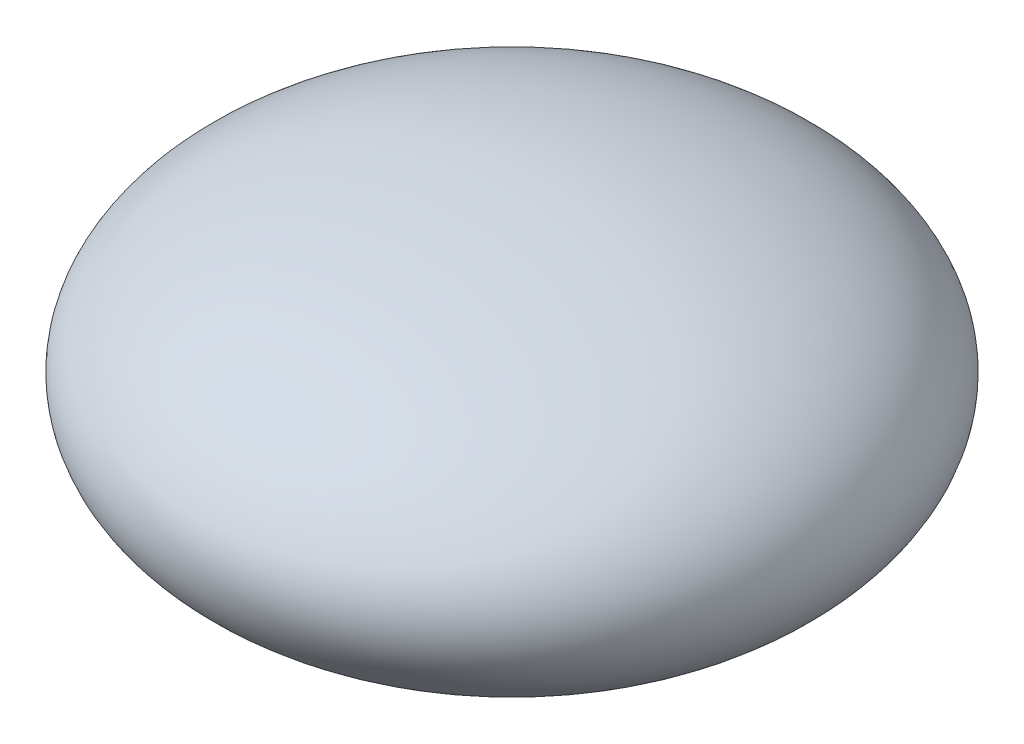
ISO-10303-21;
HEADER;
FILE_DESCRIPTION(('STEP AP214'),'2;1');
FILE_NAME('part.step','',(''),(''),'','','');
FILE_SCHEMA(('AUTOMOTIVE_DESIGN { 1 0 10303 214 1 1 1 1 }'));
ENDSEC;
DATA;
#1=APPLICATION_CONTEXT('core data for automotive mechanical design processes');
#2=APPLICATION_PROTOCOL_DEFINITION('international standard','automotive_design',2000,#1);
#3=PRODUCT_CONTEXT('',#1,'mechanical');
#4=PRODUCT('Part','Part','',(#3));
#5=PRODUCT_RELATED_PRODUCT_CATEGORY('part','',(#4));
#6=PRODUCT_DEFINITION_FORMATION('','',#4);
#7=PRODUCT_DEFINITION_CONTEXT('part definition',#1,'design');
#8=PRODUCT_DEFINITION('design','',#6,#7);
#9=PRODUCT_DEFINITION_SHAPE('','',#8);
#10=(LENGTH_UNIT() NAMED_UNIT(*) SI_UNIT(.MILLI.,.METRE.));
#11=(NAMED_UNIT(*) PLANE_ANGLE_UNIT() SI_UNIT($,.RADIAN.));
#12=(NAMED_UNIT(*) SI_UNIT($,.STERADIAN.) SOLID_ANGLE_UNIT());
#13=UNCERTAINTY_MEASURE_WITH_UNIT(LENGTH_MEASURE(1.E-05),#10,'distance_accuracy_value','');
#14=(GEOMETRIC_REPRESENTATION_CONTEXT(3) GLOBAL_UNCERTAINTY_ASSIGNED_CONTEXT((#13)) GLOBAL_UNIT_ASSIGNED_CONTEXT((#10,
#11,#12)) REPRESENTATION_CONTEXT('',''));
#15=CARTESIAN_POINT('',(0.,0.,0.));
#16=DIRECTION('',(0.,0.,1.));
#17=DIRECTION('',(1.,0.,0.));
#18=AXIS2_PLACEMENT_3D('',#15,#16,#17);
#19=CARTESIAN_POINT('',(0.,0.,0.));
#20=DIRECTION('',(0.,0.,1.));
#21=DIRECTION('',(-1.,0.,0.));
#22=AXIS2_PLACEMENT_3D('',#19,#20,#21);
#23=ELLIPSE('',#22,79.375,38.1);
#24=TRIMMED_CURVE('',#23,(PARAMETER_VALUE(4.71238898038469)),
(PARAMETER_VALUE(7.85398163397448)),.T.,.PARAMETER.);
#25=CARTESIAN_POINT('',(0.,38.1,0.));
#26=DIRECTION('',(0.,1.,0.));
#27=AXIS1_PLACEMENT('',#25,#26);
#28=SURFACE_OF_REVOLUTION('',#24,#27);
#29=CARTESIAN_POINT('',(0.,-38.1,0.));
#30=VERTEX_POINT('',#29);
#31=VERTEX_LOOP('',#30);
#32=FACE_BOUND('',#31,.T.);
#33=CARTESIAN_POINT('',(0.,38.1,0.));
#34=VERTEX_POINT('',#33);
#35=VERTEX_LOOP('',#34);
#36=FACE_BOUND('',#35,.T.);
#37=ADVANCED_FACE('F31',(#32,#36),#28,.F.);
#38=CLOSED_SHELL('',(#37));
#39=MANIFOLD_SOLID_BREP('B2',#38);
#40=ADVANCED_BREP_SHAPE_REPRESENTATION('',(#18,#39),#14);
#41=SHAPE_DEFINITION_REPRESENTATION(#9,#40);
ENDSEC;
END-ISO-10303-21;
